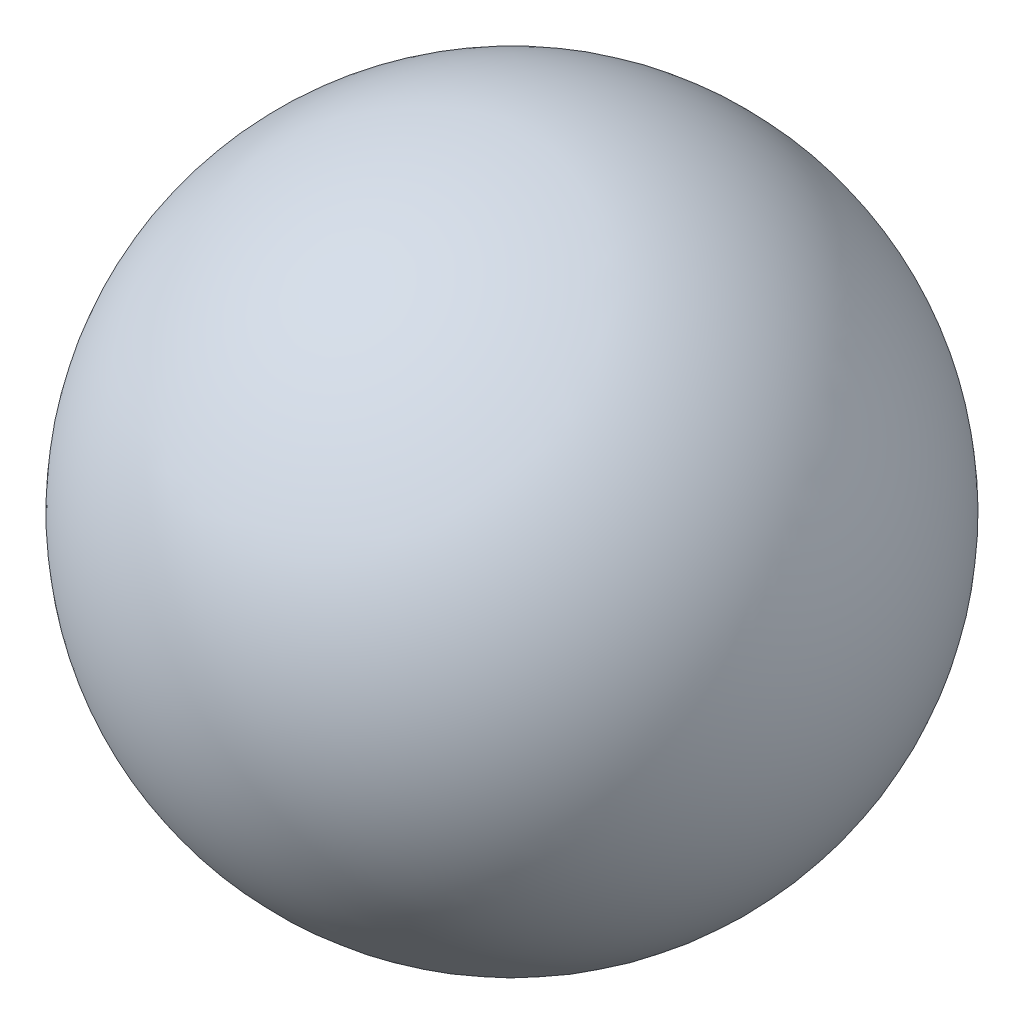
ISO-10303-21;
HEADER;
FILE_DESCRIPTION(('STEP AP214'),'2;1');
FILE_NAME('part.step','',(''),(''),'','','');
FILE_SCHEMA(('AUTOMOTIVE_DESIGN { 1 0 10303 214 1 1 1 1 }'));
ENDSEC;
DATA;
#1=APPLICATION_CONTEXT('core data for automotive mechanical design processes');
#2=APPLICATION_PROTOCOL_DEFINITION('international standard','automotive_design',2000,#1);
#3=PRODUCT_CONTEXT('',#1,'mechanical');
#4=PRODUCT('Part','Part','',(#3));
#5=PRODUCT_RELATED_PRODUCT_CATEGORY('part','',(#4));
#6=PRODUCT_DEFINITION_FORMATION('','',#4);
#7=PRODUCT_DEFINITION_CONTEXT('part definition',#1,'design');
#8=PRODUCT_DEFINITION('design','',#6,#7);
#9=PRODUCT_DEFINITION_SHAPE('','',#8);
#10=(LENGTH_UNIT() NAMED_UNIT(*) SI_UNIT(.MILLI.,.METRE.));
#11=(NAMED_UNIT(*) PLANE_ANGLE_UNIT() SI_UNIT($,.RADIAN.));
#12=(NAMED_UNIT(*) SI_UNIT($,.STERADIAN.) SOLID_ANGLE_UNIT());
#13=UNCERTAINTY_MEASURE_WITH_UNIT(LENGTH_MEASURE(1.E-05),#10,'distance_accuracy_value','');
#14=(GEOMETRIC_REPRESENTATION_CONTEXT(3) GLOBAL_UNCERTAINTY_ASSIGNED_CONTEXT((#13)) GLOBAL_UNIT_ASSIGNED_CONTEXT((#10,
#11,#12)) REPRESENTATION_CONTEXT('',''));
#15=CARTESIAN_POINT('',(0.,0.,0.));
#16=DIRECTION('',(0.,0.,1.));
#17=DIRECTION('',(1.,0.,0.));
#18=AXIS2_PLACEMENT_3D('',#15,#16,#17);
#19=CARTESIAN_POINT('',(144.734176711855,132.624433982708,-234.000002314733));
#20=DIRECTION('',(-0.737277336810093,-0.675590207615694,1.17912735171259E-08));
#21=DIRECTION('',(0.,1.74532925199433E-08,1.));
#22=AXIS2_PLACEMENT_3D('',#19,#20,#21);
#23=SPHERICAL_SURFACE('',#22,2.2);
#24=CARTESIAN_POINT('',(143.112166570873,131.138135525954,-234.000002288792));
#25=VERTEX_POINT('',#24);
#26=VERTEX_LOOP('',#25);
#27=FACE_BOUND('',#26,.T.);
#28=ADVANCED_FACE('F13',(#27),#23,.T.);
#29=CLOSED_SHELL('',(#28));
#30=MANIFOLD_SOLID_BREP('B1',#29);
#31=ADVANCED_BREP_SHAPE_REPRESENTATION('',(#18,#30),#14);
#32=SHAPE_DEFINITION_REPRESENTATION(#9,#31);
ENDSEC;
END-ISO-10303-21;
